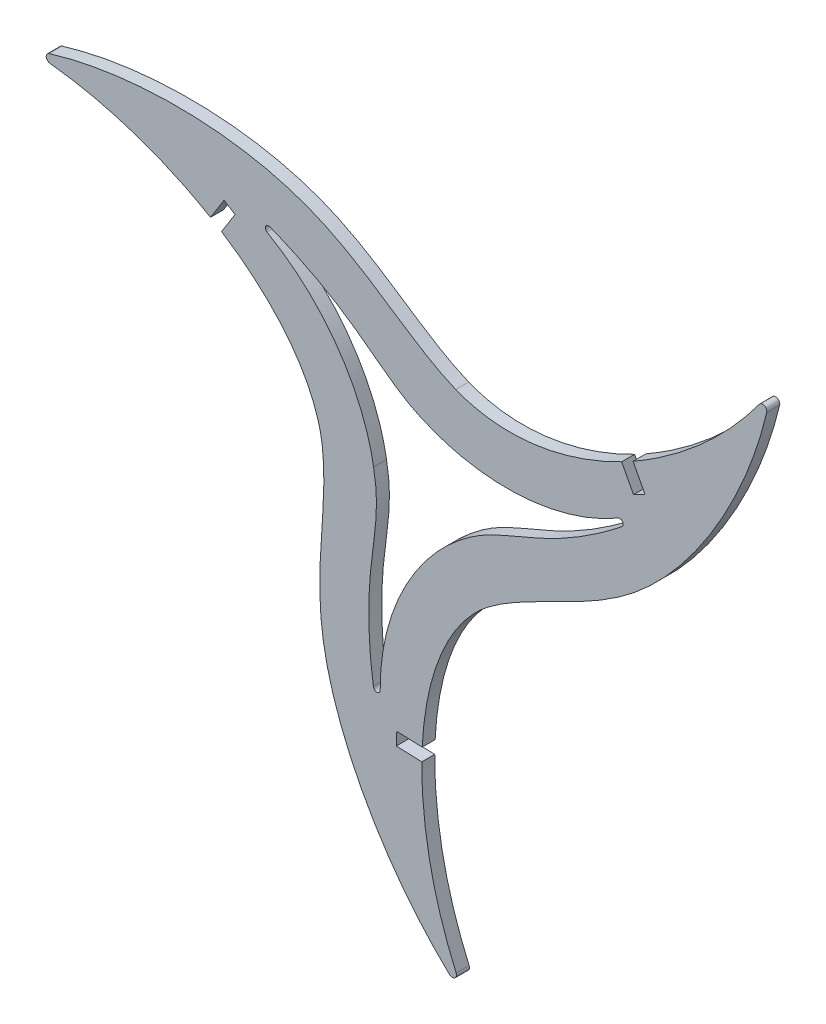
from build123d import *

# Parameters (mm, degrees)
AUFSATZ_LINEAR_AUSTRAGEN1_DEPTH = 1.5875


with BuildPart() as part:
    # Skizze1 → Aufsatz-Linear austragen1 (new, symmetric)
    with BuildSketch(Plane.XY):
        with BuildLine():
            Line((43.190150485, 33.011666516), (46.106297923, 27.475823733))
            Line((46.106297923, 27.475823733), (43.297215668, 25.996067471))
            Line((43.297215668, 25.996067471), (40.393732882, 31.507868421))
            add(Edge.make_bspline(
                [(-0.281004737, 26.519512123), (11.657211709, 21.766508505), (26.379870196, 24.307238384), (40.393732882, 31.507868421)],
                knots=[-10.967667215, -10.967667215, -10.967667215, -10.967667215, -10.468951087, -10.468951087, -10.468951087, -10.468951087], degree=3))
            add(Edge.make_bspline(
                [(-99.945720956, 48.006160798), (-79.317689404, 54.246416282), (-33.863146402, 53.782300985), (-11.864219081, 31.309586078), (-0.281004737, 26.519512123)],
                knots=[-15.419591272, -15.419591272, -15.419591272, -15.419591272, -12.964098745, -10.967667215, -10.967667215, -10.967667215, -10.967667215], degree=3))
            add(Edge.make_bspline(
                [(-100.663150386, 46.939408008), (-100.740167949, 47.765829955), (-99.945720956, 48.006160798)],
                knots=[0, 0, 0, 0.054798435, 0.054798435, 0.054798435], degree=2, weights=[1, 0.774431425, 1]))
            add(Edge.make_bspline(
                [(-99.760957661, 46.023594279), (-100.586132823, 46.112986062), (-100.663150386, 46.939408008)],
                knots=[0, 0, 0, 0.054798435, 0.054798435, 0.054798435], degree=2, weights=[1, 0.774431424, 1]))
            add(Edge.make_bspline(
                [(-60.394379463, 33.011666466), (-78.694492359, 43.702322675), (-99.760957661, 46.023594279)],
                knots=[0, 0, 0, 1.644333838, 1.644333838, 1.644333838], degree=2, weights=[1, 0.978138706, 1]))
            Line((-60.394379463, 33.011666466), (-57.058272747, 38.305045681))
            Line((-57.058272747, 38.305045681), (-54.372225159, 36.612187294))
            Line((-54.372225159, 36.612187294), (-57.69384335, 31.341796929))
            add(Edge.make_bspline(
                [(-33.036431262, -1.389380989), (-34.889317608, 11.325919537), (-44.450983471, 22.805750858), (-57.69384335, 31.341796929)],
                knots=[-17.063080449, -17.063080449, -17.063080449, -17.063080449, -16.564364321, -16.564364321, -16.564364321, -16.564364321], degree=3))
            add(Edge.make_bspline(
                [(-1.812056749, -98.444881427), (-17.530292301, -83.700609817), (-39.855628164, -44.103763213), (-31.393149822, -13.815775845), (-33.036431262, -1.389380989)],
                knots=[-21.515004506, -21.515004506, -21.515004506, -21.515004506, -19.059511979, -17.063080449, -17.063080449, -17.063080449, -17.063080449], degree=3))
            add(Edge.make_bspline(
                [(-0.529507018, -98.532817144), (-1.206700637, -99.012727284), (-1.812056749, -98.444881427)],
                knots=[0, 0, 0, 0.054798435, 0.054798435, 0.054798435], degree=2, weights=[1, 0.774431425, 1]))
            add(Edge.make_bspline(
                [(-0.187485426, -97.293588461), (0.1476866, -98.052907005), (-0.529507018, -98.532817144)],
                knots=[0, 0, 0, 0.054798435, 0.054798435, 0.054798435], degree=2, weights=[1, 0.774431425, 1]))
            add(Edge.make_bspline(
                [(-8.602114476, -56.695167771), (-8.710437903, -77.888858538), (-0.187485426, -97.293588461)],
                knots=[0, 0, 0, 1.644333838, 1.644333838, 1.644333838], degree=2, weights=[1, 0.978138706, 1]))
            Line((-8.602114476, -56.695167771), (-14.85436869, -56.452704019))
            Line((-14.85436869, -56.452704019), (-14.731334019, -53.280089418))
            Line((-14.731334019, -53.280089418), (-8.506232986, -53.521500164))
            add(Edge.make_bspline(
                [(7.511092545, -15.801965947), (-2.574237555, -23.764262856), (-7.735230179, -37.784824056), (-8.506232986, -53.521500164)],
                knots=[-4.872253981, -4.872253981, -4.872253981, -4.872253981, -4.373537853, -4.373537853, -4.373537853, -4.373537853], degree=3))
            add(Edge.make_bspline(
                [(75.951434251, 59.766885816), (71.041638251, 38.782358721), (47.912431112, -0.350372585), (17.451025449, -8.165645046), (7.511092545, -15.801965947)],
                knots=[-9.324178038, -9.324178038, -9.324178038, -9.324178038, -6.868685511, -4.872253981, -4.872253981, -4.872253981, -4.872253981], degree=3))
            add(Edge.make_bspline(
                [(75.386313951, 60.921574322), (76.140525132, 60.575062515), (75.951434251, 59.766885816)],
                knots=[0, 0, 0, 0.054798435, 0.054798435, 0.054798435], degree=2, weights=[1, 0.774431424, 1]))
            add(Edge.make_bspline(
                [(74.142099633, 60.598159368), (74.632102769, 61.26808613), (75.386313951, 60.921574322)],
                knots=[0, 0, 0, 0.054798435, 0.054798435, 0.054798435], degree=2, weights=[1, 0.774431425, 1]))
            add(Edge.make_bspline(
                [(43.190150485, 33.011666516), (61.598586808, 43.514701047), (74.142099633, 60.598159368)],
                knots=[0, 0, 0, 1.644333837, 1.644333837, 1.644333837], degree=2, weights=[1, 0.978138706, 1]))
        make_face()
        with BuildLine():
            add(Edge.make_bspline(
                [(-5.385619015, 14.899299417), (-6.370529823, 15.278098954), (-19.187260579, 20.138827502), (-23.472298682, 29.347004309), (-45.682640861, 38.219288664)],
                knots=[6.974313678, 6.974313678, 6.974313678, 6.974313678, 7.05511154, 8.05511154, 8.05511154, 8.05511154, 8.05511154], degree=3))
            add(Edge.make_bspline(
                [(-45.682640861, 38.219288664), (-45.868866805, 38.293679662), (-46.846779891, 38.683916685), (-47.574358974, 37.655387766), (-46.70407344, 36.886191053), (-46.569347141, 36.809037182)],
                knots=[-1, -1, -1, -1, -1, -1, 0, 0, 0, 0, 0, 0], degree=5))
            add(Edge.make_bspline(
                [(-46.569347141, 36.809037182), (-38.419240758, 32.141706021), (-26.346689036, 19.640450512), (-21.445238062, 6.075841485), (-20.420724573, 0)],
                knots=[0, 0, 0, 0, 0.468786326, 0.937572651, 0.937572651, 0.937572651, 0.937572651], degree=3))
            add(Edge.make_bspline(
                [(-20.420724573, 0), (-20.256319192, -1.042357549), (-18.057468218, -14.57233625), (-23.889464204, -22.887376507), (-20.467916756, -46.558239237)],
                knots=[0.937572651, 0.937572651, 0.937572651, 0.937572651, 1.018370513, 2.018370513, 2.018370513, 2.018370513, 2.018370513], degree=3))
            add(Edge.make_bspline(
                [(-20.467916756, -46.558239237), (-20.439228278, -46.756711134), (-20.288226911, -47.79872722), (-19.033705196, -47.91456473), (-18.80270407, -46.776276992), (-18.803250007, -46.621023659)],
                knots=[2.018370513, 2.018370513, 2.018370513, 2.018370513, 2.018370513, 2.018370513, 3.018370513, 3.018370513, 3.018370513, 3.018370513, 3.018370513, 3.018370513], degree=5))
            add(Edge.make_bspline(
                [(-18.803250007, -46.621023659), (-18.836275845, -37.229158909), (-14.046146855, -20.523394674), (-4.749576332, -9.496309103), (0, -5.571133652)],
                knots=[3.018370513, 3.018370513, 3.018370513, 3.018370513, 3.487156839, 3.955943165, 3.955943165, 3.955943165, 3.955943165], degree=3))
            add(Edge.make_bspline(
                [(0, -5.571133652), (0.820505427, -4.907575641), (11.438385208, 3.761674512), (21.555419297, 2.868537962), (40.344214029, 17.667116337)],
                knots=[3.955943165, 3.955943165, 3.955943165, 3.955943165, 4.036741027, 5.036741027, 5.036741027, 5.036741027, 5.036741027], degree=3))
            add(Edge.make_bspline(
                [(40.344214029, 17.667116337), (40.501751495, 17.791197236), (41.328663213, 18.442976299), (40.801720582, 19.587342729), (39.700433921, 19.218251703), (39.566253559, 19.140152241)],
                knots=[5.036741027, 5.036741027, 5.036741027, 5.036741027, 5.036741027, 5.036741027, 6.036741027, 6.036741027, 6.036741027, 6.036741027, 6.036741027, 6.036741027], degree=5))
            add(Edge.make_bspline(
                [(39.566253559, 19.140152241), (31.449173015, 14.415618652), (14.586492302, 10.211109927), (0.388470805, 12.748633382), (-5.385619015, 14.899299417)],
                knots=[6.036741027, 6.036741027, 6.036741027, 6.036741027, 6.505527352, 6.974313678, 6.974313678, 6.974313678, 6.974313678], degree=3))
        make_face(mode=Mode.SUBTRACT)
    extrude(amount=AUFSATZ_LINEAR_AUSTRAGEN1_DEPTH, both=True)


solid = part.part
